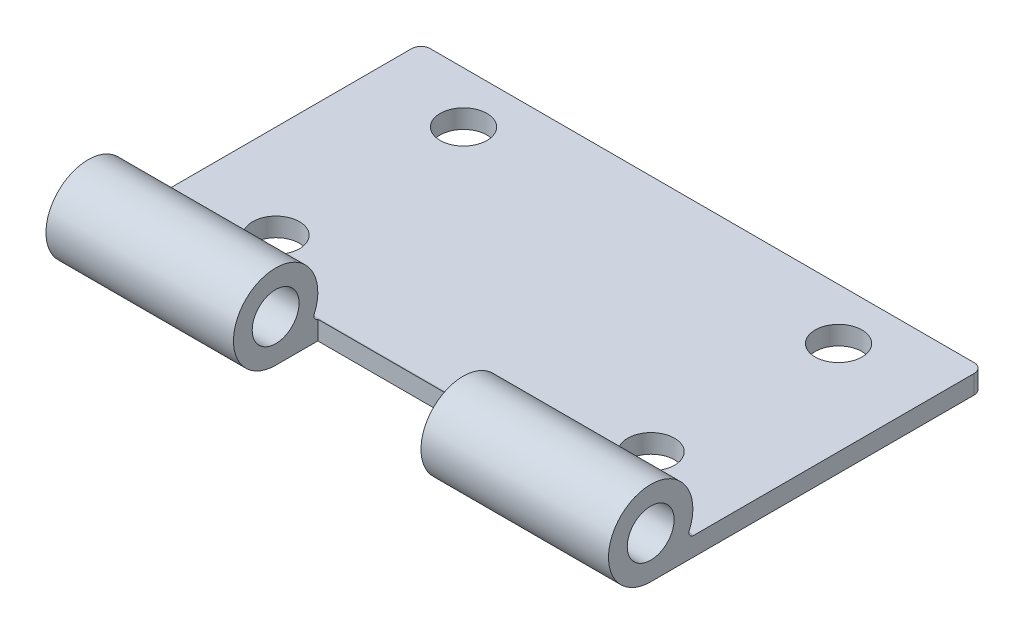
ISO-10303-21;
HEADER;
FILE_DESCRIPTION(('STEP AP214'),'2;1');
FILE_NAME('part.step','',(''),(''),'','','');
FILE_SCHEMA(('AUTOMOTIVE_DESIGN { 1 0 10303 214 1 1 1 1 }'));
ENDSEC;
DATA;
#1=APPLICATION_CONTEXT('core data for automotive mechanical design processes');
#2=APPLICATION_PROTOCOL_DEFINITION('international standard','automotive_design',2000,#1);
#3=PRODUCT_CONTEXT('',#1,'mechanical');
#4=PRODUCT('Part','Part','',(#3));
#5=PRODUCT_RELATED_PRODUCT_CATEGORY('part','',(#4));
#6=PRODUCT_DEFINITION_FORMATION('','',#4);
#7=PRODUCT_DEFINITION_CONTEXT('part definition',#1,'design');
#8=PRODUCT_DEFINITION('design','',#6,#7);
#9=PRODUCT_DEFINITION_SHAPE('','',#8);
#10=(LENGTH_UNIT() NAMED_UNIT(*) SI_UNIT(.MILLI.,.METRE.));
#11=(NAMED_UNIT(*) PLANE_ANGLE_UNIT() SI_UNIT($,.RADIAN.));
#12=(NAMED_UNIT(*) SI_UNIT($,.STERADIAN.) SOLID_ANGLE_UNIT());
#13=UNCERTAINTY_MEASURE_WITH_UNIT(LENGTH_MEASURE(1.E-05),#10,'distance_accuracy_value','');
#14=(GEOMETRIC_REPRESENTATION_CONTEXT(3) GLOBAL_UNCERTAINTY_ASSIGNED_CONTEXT((#13)) GLOBAL_UNIT_ASSIGNED_CONTEXT((#10,
#11,#12)) REPRESENTATION_CONTEXT('',''));
#15=CARTESIAN_POINT('',(0.,0.,0.));
#16=DIRECTION('',(0.,0.,1.));
#17=DIRECTION('',(1.,0.,0.));
#18=AXIS2_PLACEMENT_3D('',#15,#16,#17);
#19=CARTESIAN_POINT('',(60.,6.73802090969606,26.8686006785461));
#20=DIRECTION('',(-1.,0.,0.));
#21=DIRECTION('',(0.,0.,1.));
#22=AXIS2_PLACEMENT_3D('',#19,#20,#21);
#23=CYLINDRICAL_SURFACE('',#22,0.500000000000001);
#24=CARTESIAN_POINT('',(20.,6.73802090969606,26.8686006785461));
#25=DIRECTION('',(1.,0.,0.));
#26=DIRECTION('',(0.,0.,-1.));
#27=AXIS2_PLACEMENT_3D('',#24,#25,#26);
#28=CIRCLE('',#27,0.500000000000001);
#29=CARTESIAN_POINT('',(20.,6.24488679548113,26.9511763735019));
#30=VERTEX_POINT('',#29);
#31=CARTESIAN_POINT('',(20.,6.93802090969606,27.3268582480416));
#32=VERTEX_POINT('',#31);
#33=EDGE_CURVE('E149',#30,#32,#28,.F.);
#34=ORIENTED_EDGE('',*,*,#33,.F.);
#35=DIRECTION('',(-1.,0.,0.));
#36=VECTOR('',#35,1.);
#37=CARTESIAN_POINT('',(60.,6.24488679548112,26.9511763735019));
#38=LINE('',#37,#36);
#39=CARTESIAN_POINT('',(40.,6.24488679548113,26.9511763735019));
#40=VERTEX_POINT('',#39);
#41=EDGE_CURVE('E140',#40,#30,#38,.T.);
#42=ORIENTED_EDGE('',*,*,#41,.F.);
#43=CARTESIAN_POINT('',(40.,6.73802090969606,26.8686006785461));
#44=DIRECTION('',(-1.,0.,0.));
#45=DIRECTION('',(0.,0.,1.));
#46=AXIS2_PLACEMENT_3D('',#43,#44,#45);
#47=CIRCLE('',#46,0.500000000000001);
#48=CARTESIAN_POINT('',(40.,6.93802090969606,27.3268582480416));
#49=VERTEX_POINT('',#48);
#50=EDGE_CURVE('E125',#49,#40,#47,.F.);
#51=ORIENTED_EDGE('',*,*,#50,.F.);
#52=DIRECTION('',(-1.,0.,0.));
#53=VECTOR('',#52,1.);
#54=CARTESIAN_POINT('',(60.,6.93802090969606,27.3268582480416));
#55=LINE('',#54,#53);
#56=CARTESIAN_POINT('',(60.,6.93802090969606,27.3268582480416));
#57=VERTEX_POINT('',#56);
#58=EDGE_CURVE('E187',#57,#49,#55,.T.);
#59=ORIENTED_EDGE('',*,*,#58,.F.);
#60=CARTESIAN_POINT('',(60.,6.73802090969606,26.8686006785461));
#61=DIRECTION('',(-1.,0.,0.));
#62=DIRECTION('',(0.,0.,1.));
#63=AXIS2_PLACEMENT_3D('',#60,#61,#62);
#64=CIRCLE('',#63,0.500000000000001);
#65=CARTESIAN_POINT('',(60.,6.23802090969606,26.8686006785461));
#66=VERTEX_POINT('',#65);
#67=EDGE_CURVE('E164',#66,#57,#64,.T.);
#68=ORIENTED_EDGE('',*,*,#67,.F.);
#69=DIRECTION('',(-1.,0.,0.));
#70=VECTOR('',#69,1.);
#71=CARTESIAN_POINT('',(60.,6.23802090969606,26.8686006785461));
#72=LINE('',#71,#70);
#73=CARTESIAN_POINT('',(0.,6.23802090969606,26.8686006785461));
#74=VERTEX_POINT('',#73);
#75=EDGE_CURVE('E189',#66,#74,#72,.T.);
#76=ORIENTED_EDGE('',*,*,#75,.T.);
#77=CARTESIAN_POINT('',(0.,6.73802090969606,26.8686006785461));
#78=DIRECTION('',(-1.,0.,0.));
#79=DIRECTION('',(0.,0.,1.));
#80=AXIS2_PLACEMENT_3D('',#77,#78,#79);
#81=CIRCLE('',#80,0.500000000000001);
#82=CARTESIAN_POINT('',(0.,6.93802090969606,27.3268582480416));
#83=VERTEX_POINT('',#82);
#84=EDGE_CURVE('E174',#74,#83,#81,.T.);
#85=ORIENTED_EDGE('',*,*,#84,.T.);
#86=EDGE_CURVE('E186',#32,#83,#55,.T.);
#87=ORIENTED_EDGE('',*,*,#86,.F.);
#88=EDGE_LOOP('',(#34,#42,#51,#59,#68,#76,#85,#87));
#89=FACE_BOUND('',#88,.T.);
#90=ADVANCED_FACE('F41',(#89),#23,.F.);
#91=CARTESIAN_POINT('',(60.,8.73802090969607,31.4511763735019));
#92=DIRECTION('',(-1.,0.,0.));
#93=DIRECTION('',(0.,0.,1.));
#94=AXIS2_PLACEMENT_3D('',#91,#92,#93);
#95=CYLINDRICAL_SURFACE('',#94,4.5);
#96=DIRECTION('',(-1.,0.,0.));
#97=VECTOR('',#96,1.);
#98=CARTESIAN_POINT('',(60.,4.23802090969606,31.4511763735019));
#99=LINE('',#98,#97);
#100=CARTESIAN_POINT('',(20.,4.23802090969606,31.4511763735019));
#101=VERTEX_POINT('',#100);
#102=CARTESIAN_POINT('',(0.,4.23802090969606,31.4511763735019));
#103=VERTEX_POINT('',#102);
#104=EDGE_CURVE('E182',#101,#103,#99,.T.);
#105=ORIENTED_EDGE('',*,*,#104,.F.);
#106=CARTESIAN_POINT('',(20.,8.73802090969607,31.4511763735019));
#107=DIRECTION('',(1.,0.,0.));
#108=DIRECTION('',(0.,0.,-1.));
#109=AXIS2_PLACEMENT_3D('',#106,#107,#108);
#110=CIRCLE('',#109,4.5);
#111=EDGE_CURVE('E155',#32,#101,#110,.T.);
#112=ORIENTED_EDGE('',*,*,#111,.F.);
#113=ORIENTED_EDGE('',*,*,#86,.T.);
#114=CARTESIAN_POINT('',(0.,8.73802090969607,31.4511763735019));
#115=DIRECTION('',(1.,0.,0.));
#116=DIRECTION('',(0.,0.,-1.));
#117=AXIS2_PLACEMENT_3D('',#114,#115,#116);
#118=CIRCLE('',#117,4.5);
#119=EDGE_CURVE('E177',#83,#103,#118,.T.);
#120=ORIENTED_EDGE('',*,*,#119,.T.);
#121=EDGE_LOOP('',(#105,#112,#113,#120));
#122=FACE_BOUND('',#121,.T.);
#123=ADVANCED_FACE('F253',(#122),#95,.T.);
#124=CARTESIAN_POINT('',(40.,8.73802090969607,31.4511763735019));
#125=DIRECTION('',(-1.,0.,0.));
#126=DIRECTION('',(0.,0.,1.));
#127=AXIS2_PLACEMENT_3D('',#124,#125,#126);
#128=CIRCLE('',#127,4.5);
#129=CARTESIAN_POINT('',(40.,4.23802090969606,31.4511763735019));
#130=VERTEX_POINT('',#129);
#131=EDGE_CURVE('E131',#130,#49,#128,.T.);
#132=ORIENTED_EDGE('',*,*,#131,.F.);
#133=CARTESIAN_POINT('',(60.,4.23802090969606,31.4511763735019));
#134=VERTEX_POINT('',#133);
#135=EDGE_CURVE('E183',#134,#130,#99,.T.);
#136=ORIENTED_EDGE('',*,*,#135,.F.);
#137=CARTESIAN_POINT('',(60.,8.73802090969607,31.4511763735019));
#138=DIRECTION('',(1.,0.,0.));
#139=DIRECTION('',(0.,0.,-1.));
#140=AXIS2_PLACEMENT_3D('',#137,#138,#139);
#141=CIRCLE('',#140,4.5);
#142=EDGE_CURVE('E167',#57,#134,#141,.T.);
#143=ORIENTED_EDGE('',*,*,#142,.F.);
#144=ORIENTED_EDGE('',*,*,#58,.T.);
#145=EDGE_LOOP('',(#132,#136,#143,#144));
#146=FACE_BOUND('',#145,.T.);
#147=ADVANCED_FACE('F241',(#146),#95,.T.);
#148=CARTESIAN_POINT('',(60.,4.23802090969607,-4.0488236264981));
#149=DIRECTION('',(0.,1.,0.));
#150=DIRECTION('',(0.,0.,1.));
#151=AXIS2_PLACEMENT_3D('',#148,#149,#150);
#152=PLANE('',#151);
#153=CARTESIAN_POINT('',(50.,4.23802090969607,1.40988852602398));
#154=DIRECTION('',(0.,1.,0.));
#155=DIRECTION('',(0.,0.,1.));
#156=AXIS2_PLACEMENT_3D('',#153,#154,#155);
#157=CIRCLE('',#156,2.5);
#158=CARTESIAN_POINT('',(50.,4.23802090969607,3.90988852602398));
#159=VERTEX_POINT('',#158);
#160=EDGE_CURVE('E417',#159,#159,#157,.T.);
#161=ORIENTED_EDGE('',*,*,#160,.T.);
#162=EDGE_LOOP('',(#161));
#163=FACE_BOUND('',#162,.T.);
#164=CARTESIAN_POINT('',(50.,4.23802090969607,21.409888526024));
#165=DIRECTION('',(0.,1.,0.));
#166=DIRECTION('',(0.,0.,1.));
#167=AXIS2_PLACEMENT_3D('',#164,#165,#166);
#168=CIRCLE('',#167,2.5);
#169=CARTESIAN_POINT('',(50.,4.23802090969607,23.909888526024));
#170=VERTEX_POINT('',#169);
#171=EDGE_CURVE('E421',#170,#170,#168,.T.);
#172=ORIENTED_EDGE('',*,*,#171,.T.);
#173=EDGE_LOOP('',(#172));
#174=FACE_BOUND('',#173,.T.);
#175=CARTESIAN_POINT('',(9.99999999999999,4.23802090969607,21.409888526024));
#176=DIRECTION('',(0.,1.,0.));
#177=DIRECTION('',(0.,0.,1.));
#178=AXIS2_PLACEMENT_3D('',#175,#176,#177);
#179=CIRCLE('',#178,2.5);
#180=CARTESIAN_POINT('',(9.99999999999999,4.23802090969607,23.909888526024));
#181=VERTEX_POINT('',#180);
#182=EDGE_CURVE('E425',#181,#181,#179,.T.);
#183=ORIENTED_EDGE('',*,*,#182,.T.);
#184=EDGE_LOOP('',(#183));
#185=FACE_BOUND('',#184,.T.);
#186=CARTESIAN_POINT('',(9.99999999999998,4.23802090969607,1.40988852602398));
#187=DIRECTION('',(0.,1.,0.));
#188=DIRECTION('',(0.,0.,1.));
#189=AXIS2_PLACEMENT_3D('',#186,#187,#188);
#190=CIRCLE('',#189,2.5);
#191=CARTESIAN_POINT('',(9.99999999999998,4.23802090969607,3.90988852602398));
#192=VERTEX_POINT('',#191);
#193=EDGE_CURVE('E428',#192,#192,#190,.T.);
#194=ORIENTED_EDGE('',*,*,#193,.T.);
#195=EDGE_LOOP('',(#194));
#196=FACE_BOUND('',#195,.T.);
#197=DIRECTION('',(-1.,0.,0.));
#198=VECTOR('',#197,1.);
#199=CARTESIAN_POINT('',(60.,4.23802090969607,-4.0488236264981));
#200=LINE('',#199,#198);
#201=CARTESIAN_POINT('',(59.,4.23802090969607,-4.0488236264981));
#202=VERTEX_POINT('',#201);
#203=CARTESIAN_POINT('',(1.00000000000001,4.23802090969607,-4.0488236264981));
#204=VERTEX_POINT('',#203);
#205=EDGE_CURVE('E172',#202,#204,#200,.T.);
#206=ORIENTED_EDGE('',*,*,#205,.F.);
#207=CARTESIAN_POINT('',(59.,4.23802090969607,-3.0488236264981));
#208=DIRECTION('',(0.,1.,0.));
#209=DIRECTION('',(0.,0.,1.));
#210=AXIS2_PLACEMENT_3D('',#207,#208,#209);
#211=CIRCLE('',#210,1.);
#212=CARTESIAN_POINT('',(60.,4.23802090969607,-3.0488236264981));
#213=VERTEX_POINT('',#212);
#214=EDGE_CURVE('E49',#202,#213,#211,.F.);
#215=ORIENTED_EDGE('',*,*,#214,.T.);
#216=DIRECTION('',(0.,0.,-1.));
#217=VECTOR('',#216,1.);
#218=CARTESIAN_POINT('',(60.,4.23802090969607,-4.0488236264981));
#219=LINE('',#218,#217);
#220=EDGE_CURVE('E169',#134,#213,#219,.T.);
#221=ORIENTED_EDGE('',*,*,#220,.F.);
#222=ORIENTED_EDGE('',*,*,#135,.T.);
#223=DIRECTION('',(0.,0.,1.));
#224=VECTOR('',#223,1.);
#225=CARTESIAN_POINT('',(40.,4.23802090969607,-4.0488236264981));
#226=LINE('',#225,#224);
#227=CARTESIAN_POINT('',(40.,4.23802090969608,26.9511763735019));
#228=VERTEX_POINT('',#227);
#229=EDGE_CURVE('E197',#228,#130,#226,.T.);
#230=ORIENTED_EDGE('',*,*,#229,.F.);
#231=DIRECTION('',(1.,0.,0.));
#232=VECTOR('',#231,1.);
#233=CARTESIAN_POINT('',(60.,4.23802090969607,26.9511763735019));
#234=LINE('',#233,#232);
#235=CARTESIAN_POINT('',(20.,4.23802090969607,26.9511763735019));
#236=VERTEX_POINT('',#235);
#237=EDGE_CURVE('E143',#236,#228,#234,.T.);
#238=ORIENTED_EDGE('',*,*,#237,.F.);
#239=DIRECTION('',(0.,0.,-1.));
#240=VECTOR('',#239,1.);
#241=CARTESIAN_POINT('',(20.,4.23802090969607,-4.04882362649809));
#242=LINE('',#241,#240);
#243=EDGE_CURVE('E200',#101,#236,#242,.T.);
#244=ORIENTED_EDGE('',*,*,#243,.F.);
#245=ORIENTED_EDGE('',*,*,#104,.T.);
#246=DIRECTION('',(0.,0.,-1.));
#247=VECTOR('',#246,1.);
#248=CARTESIAN_POINT('',(0.,4.23802090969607,-4.0488236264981));
#249=LINE('',#248,#247);
#250=CARTESIAN_POINT('',(0.,4.23802090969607,-3.0488236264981));
#251=VERTEX_POINT('',#250);
#252=EDGE_CURVE('E165',#103,#251,#249,.T.);
#253=ORIENTED_EDGE('',*,*,#252,.T.);
#254=CARTESIAN_POINT('',(1.,4.23802090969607,-3.0488236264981));
#255=DIRECTION('',(0.,1.,0.));
#256=DIRECTION('',(0.,0.,1.));
#257=AXIS2_PLACEMENT_3D('',#254,#255,#256);
#258=CIRCLE('',#257,1.);
#259=EDGE_CURVE('E61',#251,#204,#258,.F.);
#260=ORIENTED_EDGE('',*,*,#259,.T.);
#261=EDGE_LOOP('',(#206,#215,#221,#222,#230,#238,#244,#245,#253,#260));
#262=FACE_BOUND('',#261,.T.);
#263=ADVANCED_FACE('F216',(#163,#174,#185,#196,#262),#152,.F.);
#264=CARTESIAN_POINT('',(60.,8.73802090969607,31.4511763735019));
#265=DIRECTION('',(-1.,0.,0.));
#266=DIRECTION('',(0.,0.,1.));
#267=AXIS2_PLACEMENT_3D('',#264,#265,#266);
#268=CYLINDRICAL_SURFACE('',#267,2.5);
#269=CARTESIAN_POINT('',(0.,8.73802090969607,31.4511763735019));
#270=DIRECTION('',(1.,0.,0.));
#271=DIRECTION('',(0.,0.,-1.));
#272=AXIS2_PLACEMENT_3D('',#269,#270,#271);
#273=CIRCLE('',#272,2.5);
#274=CARTESIAN_POINT('',(0.,8.73802090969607,33.9511763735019));
#275=VERTEX_POINT('',#274);
#276=EDGE_CURVE('E150',#275,#275,#273,.T.);
#277=CARTESIAN_POINT('',(20.,8.73802090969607,31.4511763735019));
#278=DIRECTION('',(1.,0.,0.));
#279=DIRECTION('',(0.,0.,-1.));
#280=AXIS2_PLACEMENT_3D('',#277,#278,#279);
#281=CIRCLE('',#280,2.5);
#282=CARTESIAN_POINT('',(20.,8.73802090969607,33.9511763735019));
#283=VERTEX_POINT('',#282);
#284=EDGE_CURVE('E136',#283,#283,#281,.T.);
#285=CARTESIAN_POINT('',(0.,8.73802090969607,33.9511763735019));
#286=CARTESIAN_POINT('',(0.208333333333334,8.73802090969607,33.9511763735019));
#287=CARTESIAN_POINT('',(0.416666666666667,8.73802090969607,33.9511763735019));
#288=CARTESIAN_POINT('',(0.833333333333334,8.73802090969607,33.9511763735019));
#289=CARTESIAN_POINT('',(1.04166666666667,8.73802090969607,33.9511763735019));
#290=CARTESIAN_POINT('',(1.45833333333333,8.73802090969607,33.9511763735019));
#291=CARTESIAN_POINT('',(1.66666666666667,8.73802090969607,33.9511763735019));
#292=CARTESIAN_POINT('',(2.08333333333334,8.73802090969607,33.9511763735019));
#293=CARTESIAN_POINT('',(2.29166666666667,8.73802090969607,33.9511763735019));
#294=CARTESIAN_POINT('',(2.70833333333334,8.73802090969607,33.9511763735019));
#295=CARTESIAN_POINT('',(2.91666666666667,8.73802090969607,33.9511763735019));
#296=CARTESIAN_POINT('',(3.33333333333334,8.73802090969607,33.9511763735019));
#297=CARTESIAN_POINT('',(3.54166666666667,8.73802090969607,33.9511763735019));
#298=CARTESIAN_POINT('',(3.95833333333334,8.73802090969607,33.9511763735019));
#299=CARTESIAN_POINT('',(4.16666666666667,8.73802090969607,33.9511763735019));
#300=CARTESIAN_POINT('',(4.58333333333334,8.73802090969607,33.9511763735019));
#301=CARTESIAN_POINT('',(4.79166666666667,8.73802090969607,33.9511763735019));
#302=CARTESIAN_POINT('',(5.20833333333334,8.73802090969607,33.9511763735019));
#303=CARTESIAN_POINT('',(5.41666666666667,8.73802090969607,33.9511763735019));
#304=CARTESIAN_POINT('',(5.83333333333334,8.73802090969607,33.9511763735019));
#305=CARTESIAN_POINT('',(6.04166666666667,8.73802090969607,33.9511763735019));
#306=CARTESIAN_POINT('',(6.45833333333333,8.73802090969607,33.9511763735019));
#307=CARTESIAN_POINT('',(6.66666666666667,8.73802090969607,33.9511763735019));
#308=CARTESIAN_POINT('',(7.08333333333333,8.73802090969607,33.9511763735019));
#309=CARTESIAN_POINT('',(7.29166666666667,8.73802090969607,33.9511763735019));
#310=CARTESIAN_POINT('',(7.70833333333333,8.73802090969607,33.9511763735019));
#311=CARTESIAN_POINT('',(7.91666666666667,8.73802090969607,33.9511763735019));
#312=CARTESIAN_POINT('',(8.33333333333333,8.73802090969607,33.9511763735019));
#313=CARTESIAN_POINT('',(8.54166666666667,8.73802090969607,33.9511763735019));
#314=CARTESIAN_POINT('',(8.95833333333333,8.73802090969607,33.9511763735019));
#315=CARTESIAN_POINT('',(9.16666666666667,8.73802090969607,33.9511763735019));
#316=CARTESIAN_POINT('',(9.58333333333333,8.73802090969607,33.9511763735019));
#317=CARTESIAN_POINT('',(9.79166666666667,8.73802090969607,33.9511763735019));
#318=CARTESIAN_POINT('',(10.2083333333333,8.73802090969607,33.9511763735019));
#319=CARTESIAN_POINT('',(10.4166666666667,8.73802090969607,33.9511763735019));
#320=CARTESIAN_POINT('',(10.8333333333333,8.73802090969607,33.9511763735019));
#321=CARTESIAN_POINT('',(11.0416666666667,8.73802090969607,33.9511763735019));
#322=CARTESIAN_POINT('',(11.4583333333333,8.73802090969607,33.9511763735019));
#323=CARTESIAN_POINT('',(11.6666666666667,8.73802090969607,33.9511763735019));
#324=CARTESIAN_POINT('',(12.0833333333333,8.73802090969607,33.9511763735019));
#325=CARTESIAN_POINT('',(12.2916666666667,8.73802090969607,33.9511763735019));
#326=CARTESIAN_POINT('',(12.7083333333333,8.73802090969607,33.9511763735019));
#327=CARTESIAN_POINT('',(12.9166666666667,8.73802090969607,33.9511763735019));
#328=CARTESIAN_POINT('',(13.3333333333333,8.73802090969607,33.9511763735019));
#329=CARTESIAN_POINT('',(13.5416666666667,8.73802090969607,33.9511763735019));
#330=CARTESIAN_POINT('',(13.9583333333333,8.73802090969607,33.9511763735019));
#331=CARTESIAN_POINT('',(14.1666666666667,8.73802090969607,33.9511763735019));
#332=CARTESIAN_POINT('',(14.5833333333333,8.73802090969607,33.9511763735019));
#333=CARTESIAN_POINT('',(14.7916666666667,8.73802090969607,33.9511763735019));
#334=CARTESIAN_POINT('',(15.2083333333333,8.73802090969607,33.9511763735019));
#335=CARTESIAN_POINT('',(15.4166666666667,8.73802090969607,33.9511763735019));
#336=CARTESIAN_POINT('',(15.8333333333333,8.73802090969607,33.9511763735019));
#337=CARTESIAN_POINT('',(16.0416666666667,8.73802090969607,33.9511763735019));
#338=CARTESIAN_POINT('',(16.4583333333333,8.73802090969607,33.9511763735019));
#339=CARTESIAN_POINT('',(16.6666666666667,8.73802090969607,33.9511763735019));
#340=CARTESIAN_POINT('',(17.0833333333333,8.73802090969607,33.9511763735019));
#341=CARTESIAN_POINT('',(17.2916666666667,8.73802090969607,33.9511763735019));
#342=CARTESIAN_POINT('',(17.7083333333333,8.73802090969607,33.9511763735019));
#343=CARTESIAN_POINT('',(17.9166666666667,8.73802090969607,33.9511763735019));
#344=CARTESIAN_POINT('',(18.3333333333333,8.73802090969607,33.9511763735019));
#345=CARTESIAN_POINT('',(18.5416666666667,8.73802090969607,33.9511763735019));
#346=CARTESIAN_POINT('',(18.9583333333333,8.73802090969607,33.9511763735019));
#347=CARTESIAN_POINT('',(19.1666666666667,8.73802090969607,33.9511763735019));
#348=CARTESIAN_POINT('',(19.5833333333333,8.73802090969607,33.9511763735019));
#349=CARTESIAN_POINT('',(19.7916666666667,8.73802090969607,33.9511763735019));
#350=CARTESIAN_POINT('',(20.,8.73802090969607,33.9511763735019));
#351=B_SPLINE_CURVE_WITH_KNOTS('',3,(#285,#286,#287,#288,#289,#290,#291,#292,#293,#294,#295,
#296,#297,#298,#299,#300,#301,#302,#303,#304,#305,#306,#307,#308,#309,#310,#311,#312,#313,#314,
#315,#316,#317,#318,#319,#320,#321,#322,#323,#324,#325,#326,#327,#328,#329,#330,#331,#332,#333,
#334,#335,#336,#337,#338,#339,#340,#341,#342,#343,#344,#345,#346,#347,#348,#349,#350),
.UNSPECIFIED.,.F.,.F.,(4,2,2,2,2,2,2,2,2,2,2,2,2,2,2,2,2,2,2,2,2,2,2,2,2,2,2,2,2,2,2,2,4),(0.,
0.625000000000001,1.25,1.875,2.5,3.125,3.75,4.375,5.,5.62500000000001,6.25,6.875,7.5,8.125,8.75,
9.375,10.,10.625,11.25,11.875,12.5,13.125,13.75,14.375,15.,15.625,16.25,16.875,17.5,18.125,
18.75,19.375,20.),.UNSPECIFIED.);
#352=EDGE_CURVE('BSEAM299',#275,#283,#351,.T.);
#353=ORIENTED_EDGE('',*,*,#276,.F.);
#354=ORIENTED_EDGE('',*,*,#284,.T.);
#355=ORIENTED_EDGE('',*,*,#352,.T.);
#356=ORIENTED_EDGE('',*,*,#352,.F.);
#357=EDGE_LOOP('',(#353,#355,#354,#356));
#358=FACE_BOUND('',#357,.T.);
#359=ADVANCED_FACE('F299',(#358),#268,.F.);
#360=CARTESIAN_POINT('',(60.,8.73802090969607,31.4511763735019));
#361=DIRECTION('',(1.,0.,0.));
#362=DIRECTION('',(0.,0.,-1.));
#363=AXIS2_PLACEMENT_3D('',#360,#361,#362);
#364=CIRCLE('',#363,2.5);
#365=CARTESIAN_POINT('',(60.,8.73802090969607,33.9511763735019));
#366=VERTEX_POINT('',#365);
#367=EDGE_CURVE('E153',#366,#366,#364,.T.);
#368=CARTESIAN_POINT('',(40.,8.73802090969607,31.4511763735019));
#369=DIRECTION('',(-1.,0.,0.));
#370=DIRECTION('',(0.,0.,1.));
#371=AXIS2_PLACEMENT_3D('',#368,#369,#370);
#372=CIRCLE('',#371,2.5);
#373=CARTESIAN_POINT('',(40.,8.73802090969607,33.9511763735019));
#374=VERTEX_POINT('',#373);
#375=EDGE_CURVE('E144',#374,#374,#372,.T.);
#376=CARTESIAN_POINT('',(60.,8.73802090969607,33.9511763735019));
#377=CARTESIAN_POINT('',(59.7916666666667,8.73802090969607,33.9511763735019));
#378=CARTESIAN_POINT('',(59.5833333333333,8.73802090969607,33.9511763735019));
#379=CARTESIAN_POINT('',(59.1666666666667,8.73802090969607,33.9511763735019));
#380=CARTESIAN_POINT('',(58.9583333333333,8.73802090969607,33.9511763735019));
#381=CARTESIAN_POINT('',(58.5416666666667,8.73802090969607,33.9511763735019));
#382=CARTESIAN_POINT('',(58.3333333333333,8.73802090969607,33.9511763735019));
#383=CARTESIAN_POINT('',(57.9166666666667,8.73802090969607,33.9511763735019));
#384=CARTESIAN_POINT('',(57.7083333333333,8.73802090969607,33.9511763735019));
#385=CARTESIAN_POINT('',(57.2916666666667,8.73802090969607,33.9511763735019));
#386=CARTESIAN_POINT('',(57.0833333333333,8.73802090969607,33.9511763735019));
#387=CARTESIAN_POINT('',(56.6666666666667,8.73802090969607,33.9511763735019));
#388=CARTESIAN_POINT('',(56.4583333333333,8.73802090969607,33.9511763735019));
#389=CARTESIAN_POINT('',(56.0416666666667,8.73802090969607,33.9511763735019));
#390=CARTESIAN_POINT('',(55.8333333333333,8.73802090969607,33.9511763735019));
#391=CARTESIAN_POINT('',(55.4166666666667,8.73802090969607,33.9511763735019));
#392=CARTESIAN_POINT('',(55.2083333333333,8.73802090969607,33.9511763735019));
#393=CARTESIAN_POINT('',(54.7916666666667,8.73802090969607,33.9511763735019));
#394=CARTESIAN_POINT('',(54.5833333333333,8.73802090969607,33.9511763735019));
#395=CARTESIAN_POINT('',(54.1666666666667,8.73802090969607,33.9511763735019));
#396=CARTESIAN_POINT('',(53.9583333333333,8.73802090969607,33.9511763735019));
#397=CARTESIAN_POINT('',(53.5416666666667,8.73802090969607,33.9511763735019));
#398=CARTESIAN_POINT('',(53.3333333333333,8.73802090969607,33.9511763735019));
#399=CARTESIAN_POINT('',(52.9166666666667,8.73802090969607,33.9511763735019));
#400=CARTESIAN_POINT('',(52.7083333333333,8.73802090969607,33.9511763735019));
#401=CARTESIAN_POINT('',(52.2916666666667,8.73802090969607,33.9511763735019));
#402=CARTESIAN_POINT('',(52.0833333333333,8.73802090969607,33.9511763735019));
#403=CARTESIAN_POINT('',(51.6666666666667,8.73802090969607,33.9511763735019));
#404=CARTESIAN_POINT('',(51.4583333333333,8.73802090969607,33.9511763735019));
#405=CARTESIAN_POINT('',(51.0416666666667,8.73802090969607,33.9511763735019));
#406=CARTESIAN_POINT('',(50.8333333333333,8.73802090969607,33.9511763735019));
#407=CARTESIAN_POINT('',(50.4166666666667,8.73802090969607,33.9511763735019));
#408=CARTESIAN_POINT('',(50.2083333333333,8.73802090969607,33.9511763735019));
#409=CARTESIAN_POINT('',(49.7916666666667,8.73802090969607,33.9511763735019));
#410=CARTESIAN_POINT('',(49.5833333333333,8.73802090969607,33.9511763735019));
#411=CARTESIAN_POINT('',(49.1666666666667,8.73802090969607,33.9511763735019));
#412=CARTESIAN_POINT('',(48.9583333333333,8.73802090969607,33.9511763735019));
#413=CARTESIAN_POINT('',(48.5416666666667,8.73802090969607,33.9511763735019));
#414=CARTESIAN_POINT('',(48.3333333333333,8.73802090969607,33.9511763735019));
#415=CARTESIAN_POINT('',(47.9166666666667,8.73802090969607,33.9511763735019));
#416=CARTESIAN_POINT('',(47.7083333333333,8.73802090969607,33.9511763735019));
#417=CARTESIAN_POINT('',(47.2916666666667,8.73802090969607,33.9511763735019));
#418=CARTESIAN_POINT('',(47.0833333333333,8.73802090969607,33.9511763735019));
#419=CARTESIAN_POINT('',(46.6666666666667,8.73802090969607,33.9511763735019));
#420=CARTESIAN_POINT('',(46.4583333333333,8.73802090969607,33.9511763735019));
#421=CARTESIAN_POINT('',(46.0416666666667,8.73802090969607,33.9511763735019));
#422=CARTESIAN_POINT('',(45.8333333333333,8.73802090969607,33.9511763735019));
#423=CARTESIAN_POINT('',(45.4166666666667,8.73802090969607,33.9511763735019));
#424=CARTESIAN_POINT('',(45.2083333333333,8.73802090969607,33.9511763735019));
#425=CARTESIAN_POINT('',(44.7916666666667,8.73802090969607,33.9511763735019));
#426=CARTESIAN_POINT('',(44.5833333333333,8.73802090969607,33.9511763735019));
#427=CARTESIAN_POINT('',(44.1666666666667,8.73802090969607,33.9511763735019));
#428=CARTESIAN_POINT('',(43.9583333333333,8.73802090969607,33.9511763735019));
#429=CARTESIAN_POINT('',(43.5416666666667,8.73802090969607,33.9511763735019));
#430=CARTESIAN_POINT('',(43.3333333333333,8.73802090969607,33.9511763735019));
#431=CARTESIAN_POINT('',(42.9166666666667,8.73802090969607,33.9511763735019));
#432=CARTESIAN_POINT('',(42.7083333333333,8.73802090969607,33.9511763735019));
#433=CARTESIAN_POINT('',(42.2916666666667,8.73802090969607,33.9511763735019));
#434=CARTESIAN_POINT('',(42.0833333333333,8.73802090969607,33.9511763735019));
#435=CARTESIAN_POINT('',(41.6666666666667,8.73802090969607,33.9511763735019));
#436=CARTESIAN_POINT('',(41.4583333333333,8.73802090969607,33.9511763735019));
#437=CARTESIAN_POINT('',(41.0416666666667,8.73802090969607,33.9511763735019));
#438=CARTESIAN_POINT('',(40.8333333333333,8.73802090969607,33.9511763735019));
#439=CARTESIAN_POINT('',(40.4166666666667,8.73802090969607,33.9511763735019));
#440=CARTESIAN_POINT('',(40.2083333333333,8.73802090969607,33.9511763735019));
#441=CARTESIAN_POINT('',(40.,8.73802090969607,33.9511763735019));
#442=B_SPLINE_CURVE_WITH_KNOTS('',3,(#376,#377,#378,#379,#380,#381,#382,#383,#384,#385,#386,
#387,#388,#389,#390,#391,#392,#393,#394,#395,#396,#397,#398,#399,#400,#401,#402,#403,#404,#405,
#406,#407,#408,#409,#410,#411,#412,#413,#414,#415,#416,#417,#418,#419,#420,#421,#422,#423,#424,
#425,#426,#427,#428,#429,#430,#431,#432,#433,#434,#435,#436,#437,#438,#439,#440,#441),
.UNSPECIFIED.,.F.,.F.,(4,2,2,2,2,2,2,2,2,2,2,2,2,2,2,2,2,2,2,2,2,2,2,2,2,2,2,2,2,2,2,2,4),(0.,
0.625000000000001,1.25,1.875,2.5,3.125,3.75,4.375,5.,5.625,6.25,6.875,7.5,8.125,8.75,9.375,10.,
10.625,11.25,11.875,12.5,13.125,13.75,14.375,15.,15.625,16.25,16.875,17.5,18.125,18.75,19.375,
20.),.UNSPECIFIED.);
#443=EDGE_CURVE('BSEAM302',#366,#374,#442,.T.);
#444=ORIENTED_EDGE('',*,*,#367,.T.);
#445=ORIENTED_EDGE('',*,*,#375,.T.);
#446=ORIENTED_EDGE('',*,*,#443,.T.);
#447=ORIENTED_EDGE('',*,*,#443,.F.);
#448=EDGE_LOOP('',(#444,#446,#445,#447));
#449=FACE_BOUND('',#448,.T.);
#450=ADVANCED_FACE('F302',(#449),#268,.F.);
#451=CARTESIAN_POINT('',(60.,6.73802090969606,26.8686006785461));
#452=DIRECTION('',(-1.,0.,0.));
#453=DIRECTION('',(0.,0.,1.));
#454=AXIS2_PLACEMENT_3D('',#451,#452,#453);
#455=PLANE('',#454);
#456=ORIENTED_EDGE('',*,*,#220,.T.);
#457=DIRECTION('',(0.,1.,0.));
#458=VECTOR('',#457,1.);
#459=CARTESIAN_POINT('',(60.,6.73802090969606,-3.0488236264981));
#460=LINE('',#459,#458);
#461=CARTESIAN_POINT('',(60.,6.23802090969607,-3.0488236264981));
#462=VERTEX_POINT('',#461);
#463=EDGE_CURVE('E202',#213,#462,#460,.T.);
#464=ORIENTED_EDGE('',*,*,#463,.T.);
#465=DIRECTION('',(0.,0.,1.));
#466=VECTOR('',#465,1.);
#467=CARTESIAN_POINT('',(60.,6.23802090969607,-4.0488236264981));
#468=LINE('',#467,#466);
#469=EDGE_CURVE('E162',#462,#66,#468,.T.);
#470=ORIENTED_EDGE('',*,*,#469,.T.);
#471=ORIENTED_EDGE('',*,*,#67,.T.);
#472=ORIENTED_EDGE('',*,*,#142,.T.);
#473=EDGE_LOOP('',(#456,#464,#470,#471,#472));
#474=FACE_BOUND('',#473,.T.);
#475=ORIENTED_EDGE('',*,*,#367,.F.);
#476=EDGE_LOOP('',(#475));
#477=FACE_BOUND('',#476,.T.);
#478=ADVANCED_FACE('F221',(#474,#477),#455,.F.);
#479=CARTESIAN_POINT('',(0.,6.73802090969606,26.8686006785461));
#480=DIRECTION('',(-1.,0.,0.));
#481=DIRECTION('',(0.,0.,1.));
#482=AXIS2_PLACEMENT_3D('',#479,#480,#481);
#483=PLANE('',#482);
#484=DIRECTION('',(0.,0.,1.));
#485=VECTOR('',#484,1.);
#486=CARTESIAN_POINT('',(0.,6.23802090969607,-4.0488236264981));
#487=LINE('',#486,#485);
#488=CARTESIAN_POINT('',(0.,6.23802090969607,-3.0488236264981));
#489=VERTEX_POINT('',#488);
#490=EDGE_CURVE('E160',#489,#74,#487,.T.);
#491=ORIENTED_EDGE('',*,*,#490,.F.);
#492=DIRECTION('',(0.,1.,0.));
#493=VECTOR('',#492,1.);
#494=CARTESIAN_POINT('',(0.,4.23802090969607,-3.0488236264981));
#495=LINE('',#494,#493);
#496=EDGE_CURVE('E11',#489,#251,#495,.F.);
#497=ORIENTED_EDGE('',*,*,#496,.T.);
#498=ORIENTED_EDGE('',*,*,#252,.F.);
#499=ORIENTED_EDGE('',*,*,#119,.F.);
#500=ORIENTED_EDGE('',*,*,#84,.F.);
#501=EDGE_LOOP('',(#491,#497,#498,#499,#500));
#502=FACE_BOUND('',#501,.T.);
#503=ORIENTED_EDGE('',*,*,#276,.T.);
#504=EDGE_LOOP('',(#503));
#505=FACE_BOUND('',#504,.T.);
#506=ADVANCED_FACE('F236',(#502,#505),#483,.T.);
#507=CARTESIAN_POINT('',(60.,4.23802090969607,-4.0488236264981));
#508=DIRECTION('',(0.,0.,1.));
#509=DIRECTION('',(1.,0.,0.));
#510=AXIS2_PLACEMENT_3D('',#507,#508,#509);
#511=PLANE('',#510);
#512=DIRECTION('',(-1.,0.,0.));
#513=VECTOR('',#512,1.);
#514=CARTESIAN_POINT('',(60.,6.23802090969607,-4.0488236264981));
#515=LINE('',#514,#513);
#516=CARTESIAN_POINT('',(59.,6.23802090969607,-4.0488236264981));
#517=VERTEX_POINT('',#516);
#518=CARTESIAN_POINT('',(1.00000000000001,6.23802090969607,-4.0488236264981));
#519=VERTEX_POINT('',#518);
#520=EDGE_CURVE('E192',#517,#519,#515,.T.);
#521=ORIENTED_EDGE('',*,*,#520,.F.);
#522=DIRECTION('',(0.,1.,0.));
#523=VECTOR('',#522,1.);
#524=CARTESIAN_POINT('',(59.,4.23802090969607,-4.0488236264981));
#525=LINE('',#524,#523);
#526=EDGE_CURVE('E212',#517,#202,#525,.F.);
#527=ORIENTED_EDGE('',*,*,#526,.T.);
#528=ORIENTED_EDGE('',*,*,#205,.T.);
#529=DIRECTION('',(0.,1.,0.));
#530=VECTOR('',#529,1.);
#531=CARTESIAN_POINT('',(1.,6.23802090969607,-4.0488236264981));
#532=LINE('',#531,#530);
#533=EDGE_CURVE('E209',#204,#519,#532,.T.);
#534=ORIENTED_EDGE('',*,*,#533,.T.);
#535=EDGE_LOOP('',(#521,#527,#528,#534));
#536=FACE_BOUND('',#535,.T.);
#537=ADVANCED_FACE('F232',(#536),#511,.F.);
#538=CARTESIAN_POINT('',(60.,6.23802090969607,-4.0488236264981));
#539=DIRECTION('',(0.,-1.,0.));
#540=DIRECTION('',(0.,0.,-1.));
#541=AXIS2_PLACEMENT_3D('',#538,#539,#540);
#542=PLANE('',#541);
#543=CARTESIAN_POINT('',(50.,6.23802090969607,1.40988852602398));
#544=DIRECTION('',(0.,1.,0.));
#545=DIRECTION('',(0.,0.,1.));
#546=AXIS2_PLACEMENT_3D('',#543,#544,#545);
#547=CIRCLE('',#546,2.5);
#548=CARTESIAN_POINT('',(50.,6.23802090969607,3.90988852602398));
#549=VERTEX_POINT('',#548);
#550=EDGE_CURVE('E439',#549,#549,#547,.T.);
#551=ORIENTED_EDGE('',*,*,#550,.F.);
#552=EDGE_LOOP('',(#551));
#553=FACE_BOUND('',#552,.T.);
#554=CARTESIAN_POINT('',(50.,6.23802090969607,21.409888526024));
#555=DIRECTION('',(0.,1.,0.));
#556=DIRECTION('',(0.,0.,1.));
#557=AXIS2_PLACEMENT_3D('',#554,#555,#556);
#558=CIRCLE('',#557,2.5);
#559=CARTESIAN_POINT('',(50.,6.23802090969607,23.909888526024));
#560=VERTEX_POINT('',#559);
#561=EDGE_CURVE('E441',#560,#560,#558,.T.);
#562=ORIENTED_EDGE('',*,*,#561,.F.);
#563=EDGE_LOOP('',(#562));
#564=FACE_BOUND('',#563,.T.);
#565=CARTESIAN_POINT('',(9.99999999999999,6.23802090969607,21.409888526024));
#566=DIRECTION('',(0.,1.,0.));
#567=DIRECTION('',(0.,0.,1.));
#568=AXIS2_PLACEMENT_3D('',#565,#566,#567);
#569=CIRCLE('',#568,2.5);
#570=CARTESIAN_POINT('',(9.99999999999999,6.23802090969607,23.909888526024));
#571=VERTEX_POINT('',#570);
#572=EDGE_CURVE('E434',#571,#571,#569,.T.);
#573=ORIENTED_EDGE('',*,*,#572,.F.);
#574=EDGE_LOOP('',(#573));
#575=FACE_BOUND('',#574,.T.);
#576=CARTESIAN_POINT('',(9.99999999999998,6.23802090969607,1.40988852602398));
#577=DIRECTION('',(0.,1.,0.));
#578=DIRECTION('',(0.,0.,1.));
#579=AXIS2_PLACEMENT_3D('',#576,#577,#578);
#580=CIRCLE('',#579,2.5);
#581=CARTESIAN_POINT('',(9.99999999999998,6.23802090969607,3.90988852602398));
#582=VERTEX_POINT('',#581);
#583=EDGE_CURVE('E430',#582,#582,#580,.T.);
#584=ORIENTED_EDGE('',*,*,#583,.F.);
#585=EDGE_LOOP('',(#584));
#586=FACE_BOUND('',#585,.T.);
#587=ORIENTED_EDGE('',*,*,#469,.F.);
#588=CARTESIAN_POINT('',(59.,6.23802090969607,-3.0488236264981));
#589=DIRECTION('',(0.,-1.,0.));
#590=DIRECTION('',(0.,0.,-1.));
#591=AXIS2_PLACEMENT_3D('',#588,#589,#590);
#592=CIRCLE('',#591,1.);
#593=EDGE_CURVE('E207',#462,#517,#592,.F.);
#594=ORIENTED_EDGE('',*,*,#593,.T.);
#595=ORIENTED_EDGE('',*,*,#520,.T.);
#596=CARTESIAN_POINT('',(1.,6.23802090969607,-3.0488236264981));
#597=DIRECTION('',(0.,-1.,0.));
#598=DIRECTION('',(0.,0.,-1.));
#599=AXIS2_PLACEMENT_3D('',#596,#597,#598);
#600=CIRCLE('',#599,1.);
#601=EDGE_CURVE('E205',#519,#489,#600,.F.);
#602=ORIENTED_EDGE('',*,*,#601,.T.);
#603=ORIENTED_EDGE('',*,*,#490,.T.);
#604=ORIENTED_EDGE('',*,*,#75,.F.);
#605=EDGE_LOOP('',(#587,#594,#595,#602,#603,#604));
#606=FACE_BOUND('',#605,.T.);
#607=ADVANCED_FACE('F229',(#553,#564,#575,#586,#606),#542,.F.);
#608=CARTESIAN_POINT('',(20.,60.,26.9511763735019));
#609=DIRECTION('',(0.,0.,1.));
#610=DIRECTION('',(1.,0.,0.));
#611=AXIS2_PLACEMENT_3D('',#608,#609,#610);
#612=PLANE('',#611);
#613=ORIENTED_EDGE('',*,*,#41,.T.);
#614=DIRECTION('',(0.,-1.,0.));
#615=VECTOR('',#614,1.);
#616=CARTESIAN_POINT('',(20.,60.,26.9511763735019));
#617=LINE('',#616,#615);
#618=EDGE_CURVE('E145',#30,#236,#617,.T.);
#619=ORIENTED_EDGE('',*,*,#618,.T.);
#620=ORIENTED_EDGE('',*,*,#237,.T.);
#621=DIRECTION('',(0.,-1.,0.));
#622=VECTOR('',#621,1.);
#623=CARTESIAN_POINT('',(40.,60.,26.9511763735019));
#624=LINE('',#623,#622);
#625=EDGE_CURVE('E129',#40,#228,#624,.T.);
#626=ORIENTED_EDGE('',*,*,#625,.F.);
#627=EDGE_LOOP('',(#613,#619,#620,#626));
#628=FACE_BOUND('',#627,.T.);
#629=ADVANCED_FACE('F139',(#628),#612,.T.);
#630=CARTESIAN_POINT('',(20.,60.,26.9511763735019));
#631=DIRECTION('',(1.,0.,0.));
#632=DIRECTION('',(0.,0.,-1.));
#633=AXIS2_PLACEMENT_3D('',#630,#631,#632);
#634=PLANE('',#633);
#635=ORIENTED_EDGE('',*,*,#284,.F.);
#636=EDGE_LOOP('',(#635));
#637=FACE_BOUND('',#636,.T.);
#638=ORIENTED_EDGE('',*,*,#33,.T.);
#639=ORIENTED_EDGE('',*,*,#111,.T.);
#640=ORIENTED_EDGE('',*,*,#243,.T.);
#641=ORIENTED_EDGE('',*,*,#618,.F.);
#642=EDGE_LOOP('',(#638,#639,#640,#641));
#643=FACE_BOUND('',#642,.T.);
#644=ADVANCED_FACE('F250',(#637,#643),#634,.T.);
#645=CARTESIAN_POINT('',(40.,60.,26.9511763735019));
#646=DIRECTION('',(-1.,0.,0.));
#647=DIRECTION('',(0.,0.,1.));
#648=AXIS2_PLACEMENT_3D('',#645,#646,#647);
#649=PLANE('',#648);
#650=ORIENTED_EDGE('',*,*,#375,.F.);
#651=EDGE_LOOP('',(#650));
#652=FACE_BOUND('',#651,.T.);
#653=ORIENTED_EDGE('',*,*,#50,.T.);
#654=ORIENTED_EDGE('',*,*,#625,.T.);
#655=ORIENTED_EDGE('',*,*,#229,.T.);
#656=ORIENTED_EDGE('',*,*,#131,.T.);
#657=EDGE_LOOP('',(#653,#654,#655,#656));
#658=FACE_BOUND('',#657,.T.);
#659=ADVANCED_FACE('F127',(#652,#658),#649,.T.);
#660=CARTESIAN_POINT('',(9.99999999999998,-53.7619790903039,1.40988852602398));
#661=DIRECTION('',(0.,1.,0.));
#662=DIRECTION('',(0.,0.,1.));
#663=AXIS2_PLACEMENT_3D('',#660,#661,#662);
#664=CYLINDRICAL_SURFACE('',#663,2.5);
#665=ORIENTED_EDGE('',*,*,#583,.T.);
#666=EDGE_LOOP('',(#665));
#667=FACE_BOUND('',#666,.T.);
#668=ORIENTED_EDGE('',*,*,#193,.F.);
#669=EDGE_LOOP('',(#668));
#670=FACE_BOUND('',#669,.T.);
#671=ADVANCED_FACE('F287',(#667,#670),#664,.F.);
#672=CARTESIAN_POINT('',(9.99999999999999,-53.7619790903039,21.409888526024));
#673=DIRECTION('',(0.,1.,0.));
#674=DIRECTION('',(0.,0.,1.));
#675=AXIS2_PLACEMENT_3D('',#672,#673,#674);
#676=CYLINDRICAL_SURFACE('',#675,2.5);
#677=ORIENTED_EDGE('',*,*,#572,.T.);
#678=EDGE_LOOP('',(#677));
#679=FACE_BOUND('',#678,.T.);
#680=ORIENTED_EDGE('',*,*,#182,.F.);
#681=EDGE_LOOP('',(#680));
#682=FACE_BOUND('',#681,.T.);
#683=ADVANCED_FACE('F280',(#679,#682),#676,.F.);
#684=CARTESIAN_POINT('',(50.,-53.7619790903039,21.409888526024));
#685=DIRECTION('',(0.,1.,0.));
#686=DIRECTION('',(0.,0.,1.));
#687=AXIS2_PLACEMENT_3D('',#684,#685,#686);
#688=CYLINDRICAL_SURFACE('',#687,2.5);
#689=ORIENTED_EDGE('',*,*,#561,.T.);
#690=EDGE_LOOP('',(#689));
#691=FACE_BOUND('',#690,.T.);
#692=ORIENTED_EDGE('',*,*,#171,.F.);
#693=EDGE_LOOP('',(#692));
#694=FACE_BOUND('',#693,.T.);
#695=ADVANCED_FACE('F274',(#691,#694),#688,.F.);
#696=CARTESIAN_POINT('',(50.,-53.7619790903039,1.40988852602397));
#697=DIRECTION('',(0.,1.,0.));
#698=DIRECTION('',(0.,0.,1.));
#699=AXIS2_PLACEMENT_3D('',#696,#697,#698);
#700=CYLINDRICAL_SURFACE('',#699,2.5);
#701=ORIENTED_EDGE('',*,*,#550,.T.);
#702=EDGE_LOOP('',(#701));
#703=FACE_BOUND('',#702,.T.);
#704=ORIENTED_EDGE('',*,*,#160,.F.);
#705=EDGE_LOOP('',(#704));
#706=FACE_BOUND('',#705,.T.);
#707=ADVANCED_FACE('F269',(#703,#706),#700,.F.);
#708=CARTESIAN_POINT('',(59.,6.73802090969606,-3.0488236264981));
#709=DIRECTION('',(0.,1.,0.));
#710=DIRECTION('',(0.,0.,1.));
#711=AXIS2_PLACEMENT_3D('',#708,#709,#710);
#712=CYLINDRICAL_SURFACE('',#711,1.);
#713=ORIENTED_EDGE('',*,*,#214,.F.);
#714=ORIENTED_EDGE('',*,*,#526,.F.);
#715=ORIENTED_EDGE('',*,*,#593,.F.);
#716=ORIENTED_EDGE('',*,*,#463,.F.);
#717=EDGE_LOOP('',(#713,#714,#715,#716));
#718=FACE_BOUND('',#717,.T.);
#719=ADVANCED_FACE('F226',(#718),#712,.T.);
#720=CARTESIAN_POINT('',(1.,4.23802090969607,-3.0488236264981));
#721=DIRECTION('',(0.,-1.,0.));
#722=DIRECTION('',(0.,0.,-1.));
#723=AXIS2_PLACEMENT_3D('',#720,#721,#722);
#724=CYLINDRICAL_SURFACE('',#723,1.);
#725=ORIENTED_EDGE('',*,*,#259,.F.);
#726=ORIENTED_EDGE('',*,*,#496,.F.);
#727=ORIENTED_EDGE('',*,*,#601,.F.);
#728=ORIENTED_EDGE('',*,*,#533,.F.);
#729=EDGE_LOOP('',(#725,#726,#727,#728));
#730=FACE_BOUND('',#729,.T.);
#731=ADVANCED_FACE('F43',(#730),#724,.T.);
#732=CLOSED_SHELL('',(#90,#123,#147,#263,#359,#450,#478,#506,#537,#607,#629,#644,#659,#671,#683,
#695,#707,#719,#731));
#733=MANIFOLD_SOLID_BREP('B2',#732);
#734=ADVANCED_BREP_SHAPE_REPRESENTATION('',(#18,#733),#14);
#735=SHAPE_DEFINITION_REPRESENTATION(#9,#734);
ENDSEC;
END-ISO-10303-21;
